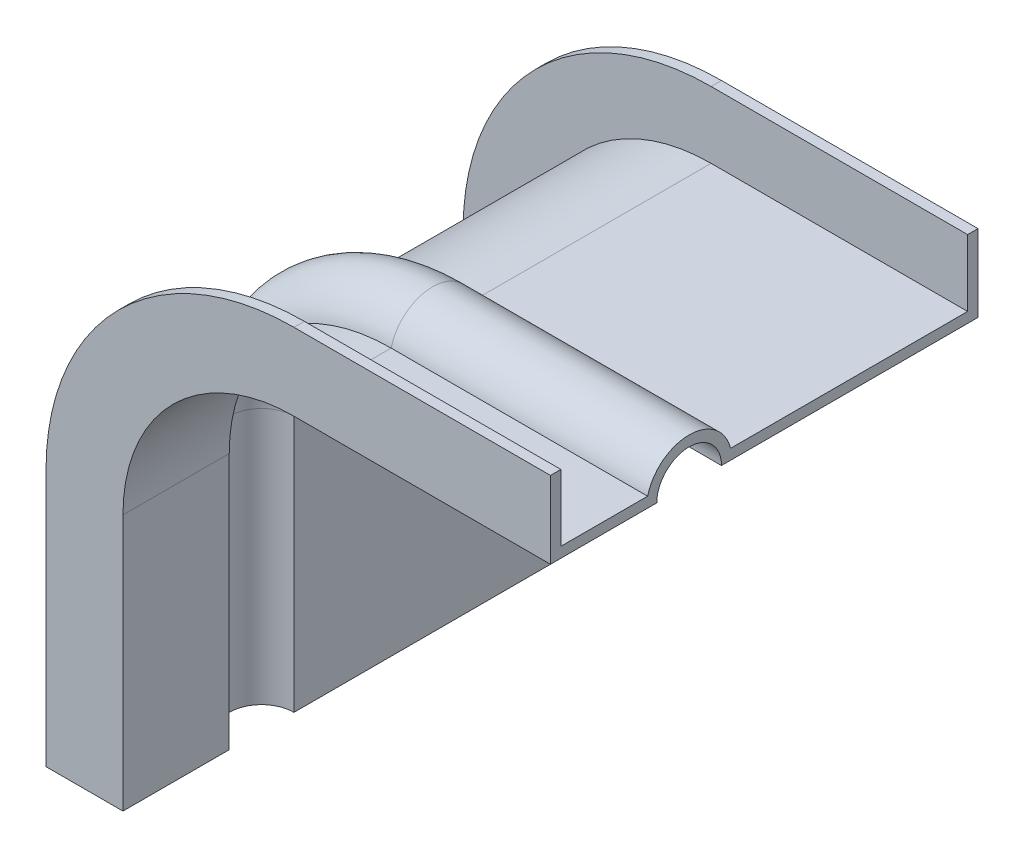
from build123d import *


with BuildPart() as part:
    # Sweep1: sweep along a path in Sketch1
    with BuildLine(Plane.XY) as sweep1_path:
        Line((0, 0), (0, 30))
        ThreePointArc((0, 30), (5.857864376, 44.142135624), (20, 50))
        Line((20, 50), (50, 50))
    # Sketch2 → Sweep1 (sweep)
    with BuildSketch(Plane(origin=(0, 0, 0), x_dir=(1, 0, 0), z_dir=(0, 1, 0))):
        with BuildLine():
            Line((-9, -50), (-9, -48.786))
            Line((-9, -48.786), (-1.214, -48.786))
            Line((-1.214, -48.786), (-1.214, -38.636381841))
            ThreePointArc((-1.214, -38.636381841), (-5, -33.786), (-1.214, -28.935618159))
            Line((-1.214, -28.935618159), (-1.214, -1.214))
            Line((-1.214, -1.214), (-9, -1.214))
            Line((-9, -1.214), (-9, 0))
            Line((-9, 0), (0, 0))
            Line((0, 0), (0, -30))
            ThreePointArc((0, -30), (-3.786, -33.786), (0, -37.572))
            Line((0, -37.572), (0, -50))
            Line((0, -50), (-9, -50))
        make_face()
    sweep(path=sweep1_path.line)


solid = part.part
